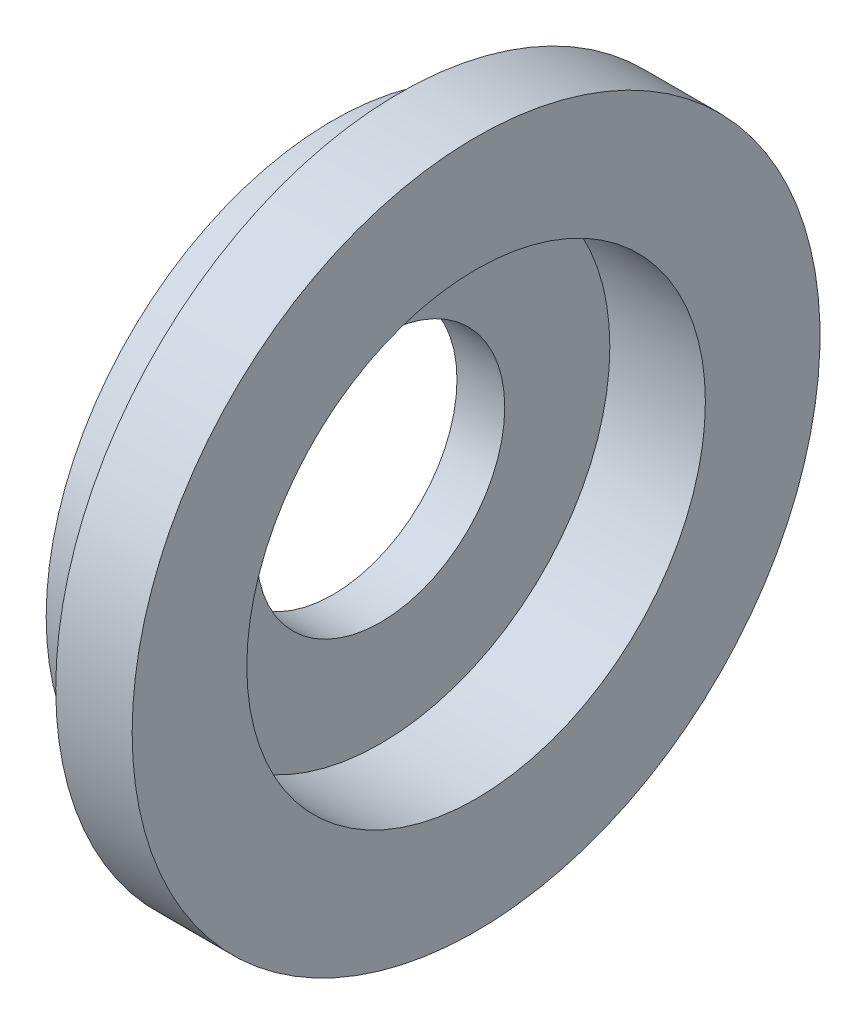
ISO-10303-21;
HEADER;
FILE_DESCRIPTION(('STEP AP214'),'2;1');
FILE_NAME('part.step','',(''),(''),'','','');
FILE_SCHEMA(('AUTOMOTIVE_DESIGN { 1 0 10303 214 1 1 1 1 }'));
ENDSEC;
DATA;
#1=APPLICATION_CONTEXT('core data for automotive mechanical design processes');
#2=APPLICATION_PROTOCOL_DEFINITION('international standard','automotive_design',2000,#1);
#3=PRODUCT_CONTEXT('',#1,'mechanical');
#4=PRODUCT('Part','Part','',(#3));
#5=PRODUCT_RELATED_PRODUCT_CATEGORY('part','',(#4));
#6=PRODUCT_DEFINITION_FORMATION('','',#4);
#7=PRODUCT_DEFINITION_CONTEXT('part definition',#1,'design');
#8=PRODUCT_DEFINITION('design','',#6,#7);
#9=PRODUCT_DEFINITION_SHAPE('','',#8);
#10=(LENGTH_UNIT() NAMED_UNIT(*) SI_UNIT(.MILLI.,.METRE.));
#11=(NAMED_UNIT(*) PLANE_ANGLE_UNIT() SI_UNIT($,.RADIAN.));
#12=(NAMED_UNIT(*) SI_UNIT($,.STERADIAN.) SOLID_ANGLE_UNIT());
#13=UNCERTAINTY_MEASURE_WITH_UNIT(LENGTH_MEASURE(1.E-05),#10,'distance_accuracy_value','');
#14=(GEOMETRIC_REPRESENTATION_CONTEXT(3) GLOBAL_UNCERTAINTY_ASSIGNED_CONTEXT((#13)) GLOBAL_UNIT_ASSIGNED_CONTEXT((#10,
#11,#12)) REPRESENTATION_CONTEXT('',''));
#15=CARTESIAN_POINT('',(0.,0.,0.));
#16=DIRECTION('',(0.,0.,1.));
#17=DIRECTION('',(1.,0.,0.));
#18=AXIS2_PLACEMENT_3D('',#15,#16,#17);
#19=CARTESIAN_POINT('',(1.5,3.59999999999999,0.));
#20=DIRECTION('',(-1.,0.,0.));
#21=DIRECTION('',(0.,0.,1.));
#22=AXIS2_PLACEMENT_3D('',#19,#20,#21);
#23=PLANE('',#22);
#24=CARTESIAN_POINT('',(1.5,0.,0.));
#25=DIRECTION('',(-1.,0.,0.));
#26=DIRECTION('',(0.,0.,1.));
#27=AXIS2_PLACEMENT_3D('',#24,#25,#26);
#28=CIRCLE('',#27,2.4);
#29=CARTESIAN_POINT('',(1.5,0.,2.4));
#30=VERTEX_POINT('',#29);
#31=EDGE_CURVE('E19',#30,#30,#28,.T.);
#32=ORIENTED_EDGE('',*,*,#31,.T.);
#33=EDGE_LOOP('',(#32));
#34=FACE_BOUND('',#33,.T.);
#35=CARTESIAN_POINT('',(1.5,0.,0.));
#36=DIRECTION('',(-1.,0.,0.));
#37=DIRECTION('',(0.,0.,1.));
#38=AXIS2_PLACEMENT_3D('',#35,#36,#37);
#39=CIRCLE('',#38,3.6);
#40=CARTESIAN_POINT('',(1.5,0.,3.6));
#41=VERTEX_POINT('',#40);
#42=EDGE_CURVE('E41',#41,#41,#39,.T.);
#43=ORIENTED_EDGE('',*,*,#42,.F.);
#44=EDGE_LOOP('',(#43));
#45=FACE_BOUND('',#44,.T.);
#46=ADVANCED_FACE('F15',(#34,#45),#23,.F.);
#47=CARTESIAN_POINT('',(0.,0.,0.));
#48=DIRECTION('',(-1.,0.,0.));
#49=DIRECTION('',(0.,0.,1.));
#50=AXIS2_PLACEMENT_3D('',#47,#48,#49);
#51=CYLINDRICAL_SURFACE('',#50,2.4);
#52=ORIENTED_EDGE('',*,*,#31,.F.);
#53=EDGE_LOOP('',(#52));
#54=FACE_BOUND('',#53,.T.);
#55=CARTESIAN_POINT('',(0.5,0.,0.));
#56=DIRECTION('',(-1.,0.,0.));
#57=DIRECTION('',(0.,0.,1.));
#58=AXIS2_PLACEMENT_3D('',#55,#56,#57);
#59=CIRCLE('',#58,2.4);
#60=CARTESIAN_POINT('',(0.5,0.,2.4));
#61=VERTEX_POINT('',#60);
#62=EDGE_CURVE('E39',#61,#61,#59,.T.);
#63=ORIENTED_EDGE('',*,*,#62,.T.);
#64=EDGE_LOOP('',(#63));
#65=FACE_BOUND('',#64,.T.);
#66=ADVANCED_FACE('F50',(#54,#65),#51,.F.);
#67=CARTESIAN_POINT('',(0.,0.,0.));
#68=DIRECTION('',(-1.,0.,0.));
#69=DIRECTION('',(0.,0.,1.));
#70=AXIS2_PLACEMENT_3D('',#67,#68,#69);
#71=CYLINDRICAL_SURFACE('',#70,3.6);
#72=CARTESIAN_POINT('',(0.699999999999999,0.,0.));
#73=DIRECTION('',(-1.,0.,0.));
#74=DIRECTION('',(0.,0.,1.));
#75=AXIS2_PLACEMENT_3D('',#72,#73,#74);
#76=CIRCLE('',#75,3.6);
#77=CARTESIAN_POINT('',(0.699999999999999,0.,3.6));
#78=VERTEX_POINT('',#77);
#79=EDGE_CURVE('E36',#78,#78,#76,.F.);
#80=ORIENTED_EDGE('',*,*,#79,.T.);
#81=EDGE_LOOP('',(#80));
#82=FACE_BOUND('',#81,.T.);
#83=ORIENTED_EDGE('',*,*,#42,.T.);
#84=EDGE_LOOP('',(#83));
#85=FACE_BOUND('',#84,.T.);
#86=ADVANCED_FACE('F53',(#82,#85),#71,.T.);
#87=CARTESIAN_POINT('',(0.5,2.4,0.));
#88=DIRECTION('',(-1.,0.,0.));
#89=DIRECTION('',(0.,0.,1.));
#90=AXIS2_PLACEMENT_3D('',#87,#88,#89);
#91=PLANE('',#90);
#92=CARTESIAN_POINT('',(0.5,0.,0.));
#93=DIRECTION('',(-1.,0.,0.));
#94=DIRECTION('',(0.,0.,1.));
#95=AXIS2_PLACEMENT_3D('',#92,#93,#94);
#96=CIRCLE('',#95,1.3);
#97=CARTESIAN_POINT('',(0.5,0.,1.3));
#98=VERTEX_POINT('',#97);
#99=EDGE_CURVE('E33',#98,#98,#96,.T.);
#100=ORIENTED_EDGE('',*,*,#99,.T.);
#101=EDGE_LOOP('',(#100));
#102=FACE_BOUND('',#101,.T.);
#103=ORIENTED_EDGE('',*,*,#62,.F.);
#104=EDGE_LOOP('',(#103));
#105=FACE_BOUND('',#104,.T.);
#106=ADVANCED_FACE('F57',(#102,#105),#91,.F.);
#107=CARTESIAN_POINT('',(0.699999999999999,3.,0.));
#108=DIRECTION('',(1.,0.,0.));
#109=DIRECTION('',(0.,0.,-1.));
#110=AXIS2_PLACEMENT_3D('',#107,#108,#109);
#111=PLANE('',#110);
#112=ORIENTED_EDGE('',*,*,#79,.F.);
#113=EDGE_LOOP('',(#112));
#114=FACE_BOUND('',#113,.T.);
#115=CARTESIAN_POINT('',(0.699999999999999,0.,0.));
#116=DIRECTION('',(-1.,0.,0.));
#117=DIRECTION('',(0.,0.,1.));
#118=AXIS2_PLACEMENT_3D('',#115,#116,#117);
#119=CIRCLE('',#118,3.);
#120=CARTESIAN_POINT('',(0.699999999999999,0.,3.));
#121=VERTEX_POINT('',#120);
#122=EDGE_CURVE('E28',#121,#121,#119,.T.);
#123=ORIENTED_EDGE('',*,*,#122,.F.);
#124=EDGE_LOOP('',(#123));
#125=FACE_BOUND('',#124,.T.);
#126=ADVANCED_FACE('F59',(#114,#125),#111,.F.);
#127=CARTESIAN_POINT('',(0.,0.,0.));
#128=DIRECTION('',(-1.,0.,0.));
#129=DIRECTION('',(0.,0.,1.));
#130=AXIS2_PLACEMENT_3D('',#127,#128,#129);
#131=CYLINDRICAL_SURFACE('',#130,1.3);
#132=ORIENTED_EDGE('',*,*,#99,.F.);
#133=EDGE_LOOP('',(#132));
#134=FACE_BOUND('',#133,.T.);
#135=CARTESIAN_POINT('',(0.,0.,0.));
#136=DIRECTION('',(-1.,0.,0.));
#137=DIRECTION('',(0.,0.,1.));
#138=AXIS2_PLACEMENT_3D('',#135,#136,#137);
#139=CIRCLE('',#138,1.3);
#140=CARTESIAN_POINT('',(0.,0.,1.3));
#141=VERTEX_POINT('',#140);
#142=EDGE_CURVE('E23',#141,#141,#139,.T.);
#143=ORIENTED_EDGE('',*,*,#142,.T.);
#144=EDGE_LOOP('',(#143));
#145=FACE_BOUND('',#144,.T.);
#146=ADVANCED_FACE('F67',(#134,#145),#131,.F.);
#147=CARTESIAN_POINT('',(0.,0.,0.));
#148=DIRECTION('',(-1.,0.,0.));
#149=DIRECTION('',(0.,0.,1.));
#150=AXIS2_PLACEMENT_3D('',#147,#148,#149);
#151=CYLINDRICAL_SURFACE('',#150,3.);
#152=CARTESIAN_POINT('',(0.,0.,0.));
#153=DIRECTION('',(-1.,0.,0.));
#154=DIRECTION('',(0.,0.,1.));
#155=AXIS2_PLACEMENT_3D('',#152,#153,#154);
#156=CIRCLE('',#155,3.);
#157=CARTESIAN_POINT('',(0.,0.,3.));
#158=VERTEX_POINT('',#157);
#159=EDGE_CURVE('E10',#158,#158,#156,.F.);
#160=ORIENTED_EDGE('',*,*,#159,.T.);
#161=EDGE_LOOP('',(#160));
#162=FACE_BOUND('',#161,.T.);
#163=ORIENTED_EDGE('',*,*,#122,.T.);
#164=EDGE_LOOP('',(#163));
#165=FACE_BOUND('',#164,.T.);
#166=ADVANCED_FACE('F74',(#162,#165),#151,.T.);
#167=CARTESIAN_POINT('',(0.,1.3,0.));
#168=DIRECTION('',(1.,0.,0.));
#169=DIRECTION('',(0.,0.,-1.));
#170=AXIS2_PLACEMENT_3D('',#167,#168,#169);
#171=PLANE('',#170);
#172=ORIENTED_EDGE('',*,*,#159,.F.);
#173=EDGE_LOOP('',(#172));
#174=FACE_BOUND('',#173,.T.);
#175=ORIENTED_EDGE('',*,*,#142,.F.);
#176=EDGE_LOOP('',(#175));
#177=FACE_BOUND('',#176,.T.);
#178=ADVANCED_FACE('F17',(#174,#177),#171,.F.);
#179=CLOSED_SHELL('',(#46,#66,#86,#106,#126,#146,#166,#178));
#180=MANIFOLD_SOLID_BREP('B1',#179);
#181=ADVANCED_BREP_SHAPE_REPRESENTATION('',(#18,#180),#14);
#182=SHAPE_DEFINITION_REPRESENTATION(#9,#181);
ENDSEC;
END-ISO-10303-21;
